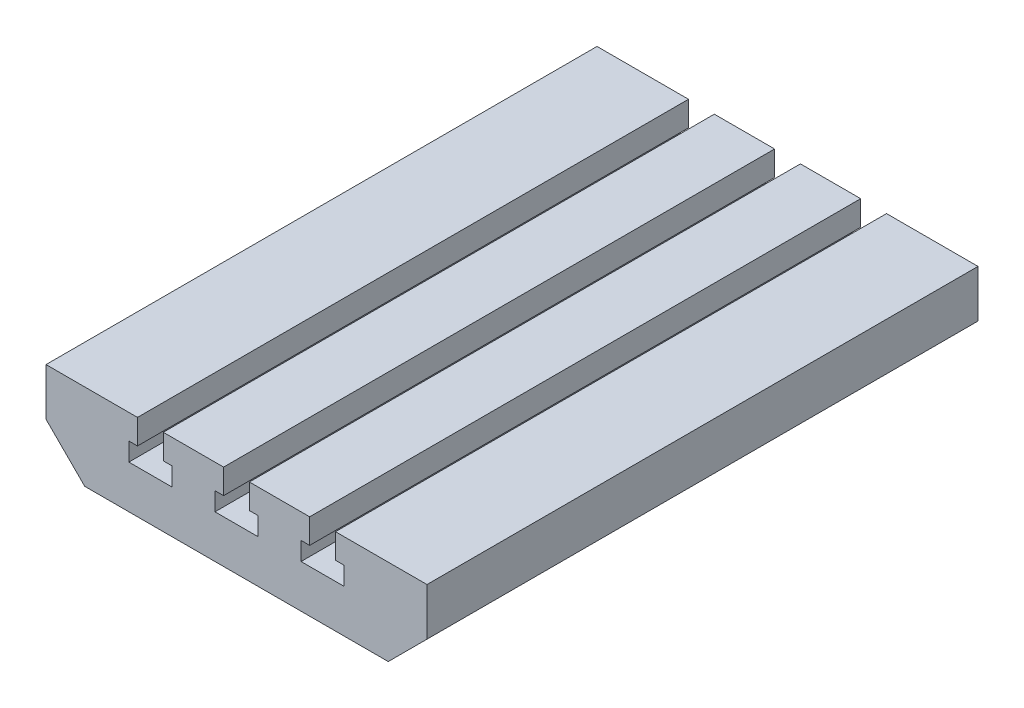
from build123d import *

# Parameters (mm, degrees)
BOSS_EXTRUDE1_DEPTH = 256


with BuildPart() as part:
    # Sketch1 → Boss-Extrude1 (new body)
    with BuildSketch(Plane.XY):
        Polygon((-88.5, 40), (-46, 40), (-46, 28.5), (-50, 28.5), (-50, 20), (-30, 20), (-30, 28.5), (-34, 28.5), (-34, 40), (-6, 40), (-6, 28.5), (-10, 28.5), (-10, 20), (10, 20), (10, 28.5), (6, 28.5), (6, 40), (34, 40), (34, 28.5), (30, 28.5), (30, 20), (50, 20), (50, 28.5), (46, 28.5), (46, 40), (88.5, 40), (88.5, 18), (70.5, 0), (-70.5, 0), (-88.5, 18), align=None)
    extrude(amount=BOSS_EXTRUDE1_DEPTH)


solid = part.part
